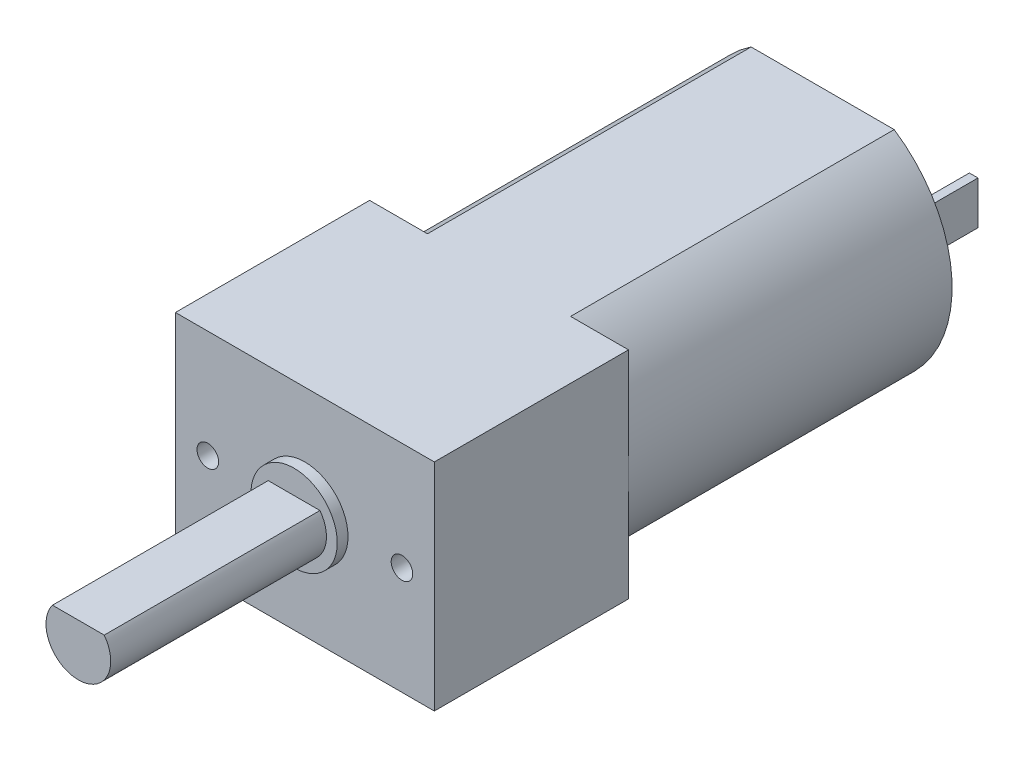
ISO-10303-21;
HEADER;
FILE_DESCRIPTION(('STEP AP214'),'2;1');
FILE_NAME('part.step','',(''),(''),'','','');
FILE_SCHEMA(('AUTOMOTIVE_DESIGN { 1 0 10303 214 1 1 1 1 }'));
ENDSEC;
DATA;
#1=APPLICATION_CONTEXT('core data for automotive mechanical design processes');
#2=APPLICATION_PROTOCOL_DEFINITION('international standard','automotive_design',2000,#1);
#3=PRODUCT_CONTEXT('',#1,'mechanical');
#4=PRODUCT('Part','Part','',(#3));
#5=PRODUCT_RELATED_PRODUCT_CATEGORY('part','',(#4));
#6=PRODUCT_DEFINITION_FORMATION('','',#4);
#7=PRODUCT_DEFINITION_CONTEXT('part definition',#1,'design');
#8=PRODUCT_DEFINITION('design','',#6,#7);
#9=PRODUCT_DEFINITION_SHAPE('','',#8);
#10=(LENGTH_UNIT() NAMED_UNIT(*) SI_UNIT(.MILLI.,.METRE.));
#11=(NAMED_UNIT(*) PLANE_ANGLE_UNIT() SI_UNIT($,.RADIAN.));
#12=(NAMED_UNIT(*) SI_UNIT($,.STERADIAN.) SOLID_ANGLE_UNIT());
#13=UNCERTAINTY_MEASURE_WITH_UNIT(LENGTH_MEASURE(1.E-05),#10,'distance_accuracy_value','');
#14=(GEOMETRIC_REPRESENTATION_CONTEXT(3) GLOBAL_UNCERTAINTY_ASSIGNED_CONTEXT((#13)) GLOBAL_UNIT_ASSIGNED_CONTEXT((#10,
#11,#12)) REPRESENTATION_CONTEXT('',''));
#15=CARTESIAN_POINT('',(0.,0.,0.));
#16=DIRECTION('',(0.,0.,1.));
#17=DIRECTION('',(1.,0.,0.));
#18=AXIS2_PLACEMENT_3D('',#15,#16,#17);
#19=CARTESIAN_POINT('',(0.,0.,19.5));
#20=DIRECTION('',(0.,0.,-1.));
#21=DIRECTION('',(-1.,0.,0.));
#22=AXIS2_PLACEMENT_3D('',#19,#20,#21);
#23=CYLINDRICAL_SURFACE('',#22,1.5);
#24=CARTESIAN_POINT('',(0.,0.,9.5));
#25=DIRECTION('',(0.,0.,1.));
#26=DIRECTION('',(1.,0.,0.));
#27=AXIS2_PLACEMENT_3D('',#24,#25,#26);
#28=CIRCLE('',#27,1.5);
#29=CARTESIAN_POINT('',(-1.2,0.899999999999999,9.5));
#30=VERTEX_POINT('',#29);
#31=CARTESIAN_POINT('',(1.2,0.899999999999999,9.5));
#32=VERTEX_POINT('',#31);
#33=EDGE_CURVE('E81',#30,#32,#28,.T.);
#34=ORIENTED_EDGE('',*,*,#33,.T.);
#35=DIRECTION('',(0.,0.,-1.));
#36=VECTOR('',#35,1.);
#37=CARTESIAN_POINT('',(1.2,0.899999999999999,19.5));
#38=LINE('',#37,#36);
#39=CARTESIAN_POINT('',(1.2,0.899999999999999,19.5));
#40=VERTEX_POINT('',#39);
#41=EDGE_CURVE('E12',#40,#32,#38,.T.);
#42=ORIENTED_EDGE('',*,*,#41,.F.);
#43=CARTESIAN_POINT('',(0.,0.,19.5));
#44=DIRECTION('',(0.,0.,1.));
#45=DIRECTION('',(1.,0.,0.));
#46=AXIS2_PLACEMENT_3D('',#43,#44,#45);
#47=CIRCLE('',#46,1.5);
#48=CARTESIAN_POINT('',(-1.2,0.899999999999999,19.5));
#49=VERTEX_POINT('',#48);
#50=EDGE_CURVE('E80',#49,#40,#47,.T.);
#51=ORIENTED_EDGE('',*,*,#50,.F.);
#52=DIRECTION('',(0.,0.,-1.));
#53=VECTOR('',#52,1.);
#54=CARTESIAN_POINT('',(-1.2,0.899999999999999,19.5));
#55=LINE('',#54,#53);
#56=EDGE_CURVE('E58',#49,#30,#55,.T.);
#57=ORIENTED_EDGE('',*,*,#56,.T.);
#58=EDGE_LOOP('',(#34,#42,#51,#57));
#59=FACE_BOUND('',#58,.T.);
#60=ADVANCED_FACE('F50',(#59),#23,.T.);
#61=CARTESIAN_POINT('',(-1.2,0.899999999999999,19.5));
#62=DIRECTION('',(0.,-1.,0.));
#63=DIRECTION('',(0.,0.,-1.));
#64=AXIS2_PLACEMENT_3D('',#61,#62,#63);
#65=PLANE('',#64);
#66=DIRECTION('',(-1.,0.,0.));
#67=VECTOR('',#66,1.);
#68=CARTESIAN_POINT('',(-1.2,0.899999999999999,9.5));
#69=LINE('',#68,#67);
#70=EDGE_CURVE('E73',#32,#30,#69,.T.);
#71=ORIENTED_EDGE('',*,*,#70,.T.);
#72=ORIENTED_EDGE('',*,*,#56,.F.);
#73=DIRECTION('',(-1.,0.,0.));
#74=VECTOR('',#73,1.);
#75=CARTESIAN_POINT('',(-1.2,0.899999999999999,19.5));
#76=LINE('',#75,#74);
#77=EDGE_CURVE('E65',#40,#49,#76,.T.);
#78=ORIENTED_EDGE('',*,*,#77,.F.);
#79=ORIENTED_EDGE('',*,*,#41,.T.);
#80=EDGE_LOOP('',(#71,#72,#78,#79));
#81=FACE_BOUND('',#80,.T.);
#82=ADVANCED_FACE('F76',(#81),#65,.F.);
#83=CARTESIAN_POINT('',(0.,0.,19.5));
#84=DIRECTION('',(0.,0.,1.));
#85=DIRECTION('',(1.,0.,0.));
#86=AXIS2_PLACEMENT_3D('',#83,#84,#85);
#87=PLANE('',#86);
#88=ORIENTED_EDGE('',*,*,#50,.T.);
#89=ORIENTED_EDGE('',*,*,#77,.T.);
#90=EDGE_LOOP('',(#88,#89));
#91=FACE_BOUND('',#90,.T.);
#92=ADVANCED_FACE('F88',(#91),#87,.T.);
#93=CARTESIAN_POINT('',(0.,0.,9.5));
#94=DIRECTION('',(0.,0.,1.));
#95=DIRECTION('',(1.,0.,0.));
#96=AXIS2_PLACEMENT_3D('',#93,#94,#95);
#97=PLANE('',#96);
#98=ORIENTED_EDGE('',*,*,#33,.F.);
#99=ORIENTED_EDGE('',*,*,#70,.F.);
#100=EDGE_LOOP('',(#98,#99));
#101=FACE_BOUND('',#100,.T.);
#102=ADVANCED_FACE('F84',(#101),#97,.F.);
#103=CLOSED_SHELL('',(#60,#82,#92,#102));
#104=MANIFOLD_SOLID_BREP('B2',#103);
#105=CARTESIAN_POINT('',(0.,0.,-15.));
#106=DIRECTION('',(0.,0.,-1.));
#107=DIRECTION('',(-1.,0.,0.));
#108=AXIS2_PLACEMENT_3D('',#105,#106,#107);
#109=PLANE('',#108);
#110=CARTESIAN_POINT('',(0.,0.,-15.));
#111=DIRECTION('',(0.,0.,-1.));
#112=DIRECTION('',(-1.,0.,0.));
#113=AXIS2_PLACEMENT_3D('',#110,#111,#112);
#114=CIRCLE('',#113,6.);
#115=CARTESIAN_POINT('',(3.3166247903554,5.,-15.));
#116=VERTEX_POINT('',#115);
#117=CARTESIAN_POINT('',(3.3166247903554,-5.,-15.));
#118=VERTEX_POINT('',#117);
#119=EDGE_CURVE('E310',#116,#118,#114,.T.);
#120=ORIENTED_EDGE('',*,*,#119,.T.);
#121=DIRECTION('',(-1.,0.,0.));
#122=VECTOR('',#121,1.);
#123=CARTESIAN_POINT('',(3.3166247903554,-5.,-15.));
#124=LINE('',#123,#122);
#125=CARTESIAN_POINT('',(-3.31662479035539,-5.,-15.));
#126=VERTEX_POINT('',#125);
#127=EDGE_CURVE('E313',#118,#126,#124,.T.);
#128=ORIENTED_EDGE('',*,*,#127,.T.);
#129=CARTESIAN_POINT('',(0.,0.,-15.));
#130=DIRECTION('',(0.,0.,-1.));
#131=DIRECTION('',(-1.,0.,0.));
#132=AXIS2_PLACEMENT_3D('',#129,#130,#131);
#133=CIRCLE('',#132,6.);
#134=CARTESIAN_POINT('',(-3.3166247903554,5.,-15.));
#135=VERTEX_POINT('',#134);
#136=EDGE_CURVE('E316',#126,#135,#133,.T.);
#137=ORIENTED_EDGE('',*,*,#136,.T.);
#138=DIRECTION('',(1.,0.,0.));
#139=VECTOR('',#138,1.);
#140=CARTESIAN_POINT('',(3.3166247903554,5.,-15.));
#141=LINE('',#140,#139);
#142=EDGE_CURVE('E318',#135,#116,#141,.T.);
#143=ORIENTED_EDGE('',*,*,#142,.T.);
#144=EDGE_LOOP('',(#120,#128,#137,#143));
#145=FACE_BOUND('',#144,.T.);
#146=DIRECTION('',(-1.,0.,0.));
#147=VECTOR('',#146,1.);
#148=CARTESIAN_POINT('',(3.2,-1.,-15.));
#149=LINE('',#148,#147);
#150=CARTESIAN_POINT('',(3.2,-1.,-15.));
#151=VERTEX_POINT('',#150);
#152=CARTESIAN_POINT('',(2.8,-1.,-15.));
#153=VERTEX_POINT('',#152);
#154=EDGE_CURVE('E276',#151,#153,#149,.T.);
#155=ORIENTED_EDGE('',*,*,#154,.F.);
#156=DIRECTION('',(0.,-1.,0.));
#157=VECTOR('',#156,1.);
#158=CARTESIAN_POINT('',(3.2,1.,-15.));
#159=LINE('',#158,#157);
#160=CARTESIAN_POINT('',(3.2,1.,-15.));
#161=VERTEX_POINT('',#160);
#162=EDGE_CURVE('E273',#161,#151,#159,.T.);
#163=ORIENTED_EDGE('',*,*,#162,.F.);
#164=DIRECTION('',(1.,0.,0.));
#165=VECTOR('',#164,1.);
#166=CARTESIAN_POINT('',(3.2,1.,-15.));
#167=LINE('',#166,#165);
#168=CARTESIAN_POINT('',(2.8,1.,-15.));
#169=VERTEX_POINT('',#168);
#170=EDGE_CURVE('E291',#169,#161,#167,.T.);
#171=ORIENTED_EDGE('',*,*,#170,.F.);
#172=DIRECTION('',(0.,1.,0.));
#173=VECTOR('',#172,1.);
#174=CARTESIAN_POINT('',(2.8,1.,-15.));
#175=LINE('',#174,#173);
#176=EDGE_CURVE('E299',#153,#169,#175,.T.);
#177=ORIENTED_EDGE('',*,*,#176,.F.);
#178=EDGE_LOOP('',(#155,#163,#171,#177));
#179=FACE_BOUND('',#178,.T.);
#180=DIRECTION('',(1.,0.,0.));
#181=VECTOR('',#180,1.);
#182=CARTESIAN_POINT('',(-3.2,1.,-15.));
#183=LINE('',#182,#181);
#184=CARTESIAN_POINT('',(-3.2,1.,-15.));
#185=VERTEX_POINT('',#184);
#186=CARTESIAN_POINT('',(-2.8,1.,-15.));
#187=VERTEX_POINT('',#186);
#188=EDGE_CURVE('E272',#185,#187,#183,.T.);
#189=ORIENTED_EDGE('',*,*,#188,.F.);
#190=DIRECTION('',(0.,1.,0.));
#191=VECTOR('',#190,1.);
#192=CARTESIAN_POINT('',(-3.2,1.,-15.));
#193=LINE('',#192,#191);
#194=CARTESIAN_POINT('',(-3.2,-1.,-15.));
#195=VERTEX_POINT('',#194);
#196=EDGE_CURVE('E267',#195,#185,#193,.T.);
#197=ORIENTED_EDGE('',*,*,#196,.F.);
#198=DIRECTION('',(-1.,0.,0.));
#199=VECTOR('',#198,1.);
#200=CARTESIAN_POINT('',(-3.2,-1.,-15.));
#201=LINE('',#200,#199);
#202=CARTESIAN_POINT('',(-2.8,-1.,-15.));
#203=VERTEX_POINT('',#202);
#204=EDGE_CURVE('E252',#203,#195,#201,.T.);
#205=ORIENTED_EDGE('',*,*,#204,.F.);
#206=DIRECTION('',(0.,-1.,0.));
#207=VECTOR('',#206,1.);
#208=CARTESIAN_POINT('',(-2.8,1.,-15.));
#209=LINE('',#208,#207);
#210=EDGE_CURVE('E260',#187,#203,#209,.T.);
#211=ORIENTED_EDGE('',*,*,#210,.F.);
#212=EDGE_LOOP('',(#189,#197,#205,#211));
#213=FACE_BOUND('',#212,.T.);
#214=ADVANCED_FACE('F129',(#145,#179,#213),#109,.T.);
#215=CARTESIAN_POINT('',(0.,0.,0.));
#216=DIRECTION('',(0.,0.,-1.));
#217=DIRECTION('',(-1.,0.,0.));
#218=AXIS2_PLACEMENT_3D('',#215,#216,#217);
#219=PLANE('',#218);
#220=CARTESIAN_POINT('',(0.,0.,0.));
#221=DIRECTION('',(0.,0.,-1.));
#222=DIRECTION('',(-1.,0.,0.));
#223=AXIS2_PLACEMENT_3D('',#220,#221,#222);
#224=CIRCLE('',#223,6.);
#225=CARTESIAN_POINT('',(3.3166247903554,5.,0.));
#226=VERTEX_POINT('',#225);
#227=CARTESIAN_POINT('',(6.,0.,0.));
#228=VERTEX_POINT('',#227);
#229=EDGE_CURVE('E140',#226,#228,#224,.T.);
#230=ORIENTED_EDGE('',*,*,#229,.F.);
#231=DIRECTION('',(-1.,0.,0.));
#232=VECTOR('',#231,1.);
#233=CARTESIAN_POINT('',(6.,5.,0.));
#234=LINE('',#233,#232);
#235=CARTESIAN_POINT('',(6.,5.,0.));
#236=VERTEX_POINT('',#235);
#237=EDGE_CURVE('E358',#236,#226,#234,.T.);
#238=ORIENTED_EDGE('',*,*,#237,.F.);
#239=DIRECTION('',(0.,1.,0.));
#240=VECTOR('',#239,1.);
#241=CARTESIAN_POINT('',(6.,5.,0.));
#242=LINE('',#241,#240);
#243=EDGE_CURVE('E372',#228,#236,#242,.T.);
#244=ORIENTED_EDGE('',*,*,#243,.F.);
#245=EDGE_LOOP('',(#230,#238,#244));
#246=FACE_BOUND('',#245,.T.);
#247=ADVANCED_FACE('F419',(#246),#219,.T.);
#248=CARTESIAN_POINT('',(3.3166247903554,-5.,0.));
#249=VERTEX_POINT('',#248);
#250=EDGE_CURVE('E48',#228,#249,#224,.T.);
#251=ORIENTED_EDGE('',*,*,#250,.F.);
#252=CARTESIAN_POINT('',(6.,-5.,0.));
#253=VERTEX_POINT('',#252);
#254=EDGE_CURVE('E373',#253,#228,#242,.T.);
#255=ORIENTED_EDGE('',*,*,#254,.F.);
#256=DIRECTION('',(1.,0.,0.));
#257=VECTOR('',#256,1.);
#258=CARTESIAN_POINT('',(6.,-5.,0.));
#259=LINE('',#258,#257);
#260=EDGE_CURVE('E368',#249,#253,#259,.T.);
#261=ORIENTED_EDGE('',*,*,#260,.F.);
#262=EDGE_LOOP('',(#251,#255,#261));
#263=FACE_BOUND('',#262,.T.);
#264=ADVANCED_FACE('F416',(#263),#219,.T.);
#265=CARTESIAN_POINT('',(0.,0.,0.));
#266=DIRECTION('',(0.,0.,-1.));
#267=DIRECTION('',(-1.,0.,0.));
#268=AXIS2_PLACEMENT_3D('',#265,#266,#267);
#269=CIRCLE('',#268,6.);
#270=CARTESIAN_POINT('',(-3.3166247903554,-5.,0.));
#271=VERTEX_POINT('',#270);
#272=CARTESIAN_POINT('',(-6.,0.,0.));
#273=VERTEX_POINT('',#272);
#274=EDGE_CURVE('E314',#271,#273,#269,.T.);
#275=ORIENTED_EDGE('',*,*,#274,.F.);
#276=CARTESIAN_POINT('',(-6.,-5.,0.));
#277=VERTEX_POINT('',#276);
#278=EDGE_CURVE('E369',#277,#271,#259,.T.);
#279=ORIENTED_EDGE('',*,*,#278,.F.);
#280=DIRECTION('',(0.,-1.,0.));
#281=VECTOR('',#280,1.);
#282=CARTESIAN_POINT('',(-6.,5.,0.));
#283=LINE('',#282,#281);
#284=EDGE_CURVE('E351',#273,#277,#283,.T.);
#285=ORIENTED_EDGE('',*,*,#284,.F.);
#286=EDGE_LOOP('',(#275,#279,#285));
#287=FACE_BOUND('',#286,.T.);
#288=ADVANCED_FACE('F400',(#287),#219,.T.);
#289=CARTESIAN_POINT('',(0.,0.,9.));
#290=DIRECTION('',(0.,0.,-1.));
#291=DIRECTION('',(-1.,0.,0.));
#292=AXIS2_PLACEMENT_3D('',#289,#290,#291);
#293=PLANE('',#292);
#294=CARTESIAN_POINT('',(0.,0.,9.));
#295=DIRECTION('',(0.,0.,1.));
#296=DIRECTION('',(1.,0.,0.));
#297=AXIS2_PLACEMENT_3D('',#294,#295,#296);
#298=CIRCLE('',#297,2.);
#299=CARTESIAN_POINT('',(2.,0.,9.));
#300=VERTEX_POINT('',#299);
#301=EDGE_CURVE('E339',#300,#300,#298,.T.);
#302=ORIENTED_EDGE('',*,*,#301,.F.);
#303=EDGE_LOOP('',(#302));
#304=FACE_BOUND('',#303,.T.);
#305=DIRECTION('',(0.,-1.,0.));
#306=VECTOR('',#305,1.);
#307=CARTESIAN_POINT('',(-6.,5.,9.));
#308=LINE('',#307,#306);
#309=CARTESIAN_POINT('',(-6.,5.,9.));
#310=VERTEX_POINT('',#309);
#311=CARTESIAN_POINT('',(-6.,-5.,9.));
#312=VERTEX_POINT('',#311);
#313=EDGE_CURVE('E354',#310,#312,#308,.T.);
#314=ORIENTED_EDGE('',*,*,#313,.T.);
#315=DIRECTION('',(1.,0.,0.));
#316=VECTOR('',#315,1.);
#317=CARTESIAN_POINT('',(6.,-5.,9.));
#318=LINE('',#317,#316);
#319=CARTESIAN_POINT('',(6.,-5.,9.));
#320=VERTEX_POINT('',#319);
#321=EDGE_CURVE('E357',#312,#320,#318,.T.);
#322=ORIENTED_EDGE('',*,*,#321,.T.);
#323=DIRECTION('',(0.,1.,0.));
#324=VECTOR('',#323,1.);
#325=CARTESIAN_POINT('',(6.,5.,9.));
#326=LINE('',#325,#324);
#327=CARTESIAN_POINT('',(6.,5.,9.));
#328=VERTEX_POINT('',#327);
#329=EDGE_CURVE('E360',#320,#328,#326,.T.);
#330=ORIENTED_EDGE('',*,*,#329,.T.);
#331=DIRECTION('',(-1.,0.,0.));
#332=VECTOR('',#331,1.);
#333=CARTESIAN_POINT('',(6.,5.,9.));
#334=LINE('',#333,#332);
#335=EDGE_CURVE('E362',#328,#310,#334,.T.);
#336=ORIENTED_EDGE('',*,*,#335,.T.);
#337=EDGE_LOOP('',(#314,#322,#330,#336));
#338=FACE_BOUND('',#337,.T.);
#339=CARTESIAN_POINT('',(-4.5,0.,9.));
#340=DIRECTION('',(0.,0.,1.));
#341=DIRECTION('',(1.,0.,0.));
#342=AXIS2_PLACEMENT_3D('',#339,#340,#341);
#343=CIRCLE('',#342,0.5);
#344=CARTESIAN_POINT('',(-4.,0.,9.));
#345=VERTEX_POINT('',#344);
#346=EDGE_CURVE('E348',#345,#345,#343,.T.);
#347=ORIENTED_EDGE('',*,*,#346,.F.);
#348=EDGE_LOOP('',(#347));
#349=FACE_BOUND('',#348,.T.);
#350=CARTESIAN_POINT('',(4.5,0.,9.));
#351=DIRECTION('',(0.,0.,1.));
#352=DIRECTION('',(1.,0.,0.));
#353=AXIS2_PLACEMENT_3D('',#350,#351,#352);
#354=CIRCLE('',#353,0.5);
#355=CARTESIAN_POINT('',(5.,0.,9.));
#356=VERTEX_POINT('',#355);
#357=EDGE_CURVE('E342',#356,#356,#354,.T.);
#358=ORIENTED_EDGE('',*,*,#357,.F.);
#359=EDGE_LOOP('',(#358));
#360=FACE_BOUND('',#359,.T.);
#361=ADVANCED_FACE('F467',(#304,#338,#349,#360),#293,.F.);
#362=CARTESIAN_POINT('',(-3.3166247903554,5.,0.));
#363=VERTEX_POINT('',#362);
#364=EDGE_CURVE('E138',#273,#363,#269,.T.);
#365=ORIENTED_EDGE('',*,*,#364,.F.);
#366=CARTESIAN_POINT('',(-6.,5.,0.));
#367=VERTEX_POINT('',#366);
#368=EDGE_CURVE('E365',#367,#273,#283,.T.);
#369=ORIENTED_EDGE('',*,*,#368,.F.);
#370=EDGE_CURVE('E376',#363,#367,#234,.T.);
#371=ORIENTED_EDGE('',*,*,#370,.F.);
#372=EDGE_LOOP('',(#365,#369,#371));
#373=FACE_BOUND('',#372,.T.);
#374=ADVANCED_FACE('F438',(#373),#219,.T.);
#375=CARTESIAN_POINT('',(-6.,5.,9.));
#376=DIRECTION('',(1.,0.,0.));
#377=DIRECTION('',(0.,1.,0.));
#378=AXIS2_PLACEMENT_3D('',#375,#376,#377);
#379=PLANE('',#378);
#380=ORIENTED_EDGE('',*,*,#368,.T.);
#381=ORIENTED_EDGE('',*,*,#284,.T.);
#382=DIRECTION('',(0.,0.,-1.));
#383=VECTOR('',#382,1.);
#384=CARTESIAN_POINT('',(-6.,-5.,9.));
#385=LINE('',#384,#383);
#386=EDGE_CURVE('E133',#312,#277,#385,.T.);
#387=ORIENTED_EDGE('',*,*,#386,.F.);
#388=ORIENTED_EDGE('',*,*,#313,.F.);
#389=DIRECTION('',(0.,0.,-1.));
#390=VECTOR('',#389,1.);
#391=CARTESIAN_POINT('',(-6.,5.,9.));
#392=LINE('',#391,#390);
#393=EDGE_CURVE('E364',#310,#367,#392,.T.);
#394=ORIENTED_EDGE('',*,*,#393,.T.);
#395=EDGE_LOOP('',(#380,#381,#387,#388,#394));
#396=FACE_BOUND('',#395,.T.);
#397=ADVANCED_FACE('F131',(#396),#379,.F.);
#398=CARTESIAN_POINT('',(6.,-5.,9.));
#399=DIRECTION('',(0.,1.,0.));
#400=DIRECTION('',(-1.,0.,0.));
#401=AXIS2_PLACEMENT_3D('',#398,#399,#400);
#402=PLANE('',#401);
#403=ORIENTED_EDGE('',*,*,#278,.T.);
#404=DIRECTION('',(0.,0.,1.));
#405=VECTOR('',#404,1.);
#406=CARTESIAN_POINT('',(-3.31662479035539,-5.,-15.));
#407=LINE('',#406,#405);
#408=EDGE_CURVE('E329',#126,#271,#407,.T.);
#409=ORIENTED_EDGE('',*,*,#408,.F.);
#410=ORIENTED_EDGE('',*,*,#127,.F.);
#411=DIRECTION('',(0.,0.,1.));
#412=VECTOR('',#411,1.);
#413=CARTESIAN_POINT('',(3.3166247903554,-5.,-15.));
#414=LINE('',#413,#412);
#415=EDGE_CURVE('E332',#118,#249,#414,.T.);
#416=ORIENTED_EDGE('',*,*,#415,.T.);
#417=ORIENTED_EDGE('',*,*,#260,.T.);
#418=DIRECTION('',(0.,0.,-1.));
#419=VECTOR('',#418,1.);
#420=CARTESIAN_POINT('',(6.,-5.,9.));
#421=LINE('',#420,#419);
#422=EDGE_CURVE('E383',#320,#253,#421,.T.);
#423=ORIENTED_EDGE('',*,*,#422,.F.);
#424=ORIENTED_EDGE('',*,*,#321,.F.);
#425=ORIENTED_EDGE('',*,*,#386,.T.);
#426=EDGE_LOOP('',(#403,#409,#410,#416,#417,#423,#424,#425));
#427=FACE_BOUND('',#426,.T.);
#428=ADVANCED_FACE('F392',(#427),#402,.F.);
#429=CARTESIAN_POINT('',(6.,5.,9.));
#430=DIRECTION('',(-1.,0.,0.));
#431=DIRECTION('',(0.,-1.,0.));
#432=AXIS2_PLACEMENT_3D('',#429,#430,#431);
#433=PLANE('',#432);
#434=ORIENTED_EDGE('',*,*,#254,.T.);
#435=ORIENTED_EDGE('',*,*,#243,.T.);
#436=DIRECTION('',(0.,0.,-1.));
#437=VECTOR('',#436,1.);
#438=CARTESIAN_POINT('',(6.,5.,9.));
#439=LINE('',#438,#437);
#440=EDGE_CURVE('E381',#328,#236,#439,.T.);
#441=ORIENTED_EDGE('',*,*,#440,.F.);
#442=ORIENTED_EDGE('',*,*,#329,.F.);
#443=ORIENTED_EDGE('',*,*,#422,.T.);
#444=EDGE_LOOP('',(#434,#435,#441,#442,#443));
#445=FACE_BOUND('',#444,.T.);
#446=ADVANCED_FACE('F421',(#445),#433,.F.);
#447=CARTESIAN_POINT('',(6.,5.,9.));
#448=DIRECTION('',(0.,-1.,0.));
#449=DIRECTION('',(1.,0.,0.));
#450=AXIS2_PLACEMENT_3D('',#447,#448,#449);
#451=PLANE('',#450);
#452=ORIENTED_EDGE('',*,*,#237,.T.);
#453=DIRECTION('',(0.,0.,1.));
#454=VECTOR('',#453,1.);
#455=CARTESIAN_POINT('',(3.3166247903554,5.,-15.));
#456=LINE('',#455,#454);
#457=EDGE_CURVE('E319',#116,#226,#456,.T.);
#458=ORIENTED_EDGE('',*,*,#457,.F.);
#459=ORIENTED_EDGE('',*,*,#142,.F.);
#460=DIRECTION('',(0.,0.,1.));
#461=VECTOR('',#460,1.);
#462=CARTESIAN_POINT('',(-3.3166247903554,5.,-15.));
#463=LINE('',#462,#461);
#464=EDGE_CURVE('E326',#135,#363,#463,.T.);
#465=ORIENTED_EDGE('',*,*,#464,.T.);
#466=ORIENTED_EDGE('',*,*,#370,.T.);
#467=ORIENTED_EDGE('',*,*,#393,.F.);
#468=ORIENTED_EDGE('',*,*,#335,.F.);
#469=ORIENTED_EDGE('',*,*,#440,.T.);
#470=EDGE_LOOP('',(#452,#458,#459,#465,#466,#467,#468,#469));
#471=FACE_BOUND('',#470,.T.);
#472=ADVANCED_FACE('F423',(#471),#451,.F.);
#473=CARTESIAN_POINT('',(-4.5,0.,9.));
#474=DIRECTION('',(0.,0.,-1.));
#475=DIRECTION('',(-1.,0.,0.));
#476=AXIS2_PLACEMENT_3D('',#473,#474,#475);
#477=CYLINDRICAL_SURFACE('',#476,0.5);
#478=ORIENTED_EDGE('',*,*,#346,.T.);
#479=EDGE_LOOP('',(#478));
#480=FACE_BOUND('',#479,.T.);
#481=CARTESIAN_POINT('',(-4.5,0.,0.));
#482=DIRECTION('',(0.,0.,1.));
#483=DIRECTION('',(1.,0.,0.));
#484=AXIS2_PLACEMENT_3D('',#481,#482,#483);
#485=CIRCLE('',#484,0.5);
#486=CARTESIAN_POINT('',(-4.,0.,0.));
#487=VERTEX_POINT('',#486);
#488=EDGE_CURVE('E345',#487,#487,#485,.T.);
#489=ORIENTED_EDGE('',*,*,#488,.F.);
#490=EDGE_LOOP('',(#489));
#491=FACE_BOUND('',#490,.T.);
#492=ADVANCED_FACE('F429',(#480,#491),#477,.F.);
#493=CARTESIAN_POINT('',(4.5,0.,9.));
#494=DIRECTION('',(0.,0.,-1.));
#495=DIRECTION('',(-1.,0.,0.));
#496=AXIS2_PLACEMENT_3D('',#493,#494,#495);
#497=CYLINDRICAL_SURFACE('',#496,0.5);
#498=ORIENTED_EDGE('',*,*,#357,.T.);
#499=EDGE_LOOP('',(#498));
#500=FACE_BOUND('',#499,.T.);
#501=CARTESIAN_POINT('',(4.5,0.,0.));
#502=DIRECTION('',(0.,0.,1.));
#503=DIRECTION('',(1.,0.,0.));
#504=AXIS2_PLACEMENT_3D('',#501,#502,#503);
#505=CIRCLE('',#504,0.5);
#506=CARTESIAN_POINT('',(5.,0.,0.));
#507=VERTEX_POINT('',#506);
#508=EDGE_CURVE('E338',#507,#507,#505,.T.);
#509=ORIENTED_EDGE('',*,*,#508,.F.);
#510=EDGE_LOOP('',(#509));
#511=FACE_BOUND('',#510,.T.);
#512=ADVANCED_FACE('F459',(#500,#511),#497,.F.);
#513=CARTESIAN_POINT('',(0.,0.,9.5));
#514=DIRECTION('',(0.,0.,-1.));
#515=DIRECTION('',(-1.,0.,0.));
#516=AXIS2_PLACEMENT_3D('',#513,#514,#515);
#517=CYLINDRICAL_SURFACE('',#516,2.);
#518=CARTESIAN_POINT('',(0.,0.,9.5));
#519=DIRECTION('',(0.,0.,1.));
#520=DIRECTION('',(1.,0.,0.));
#521=AXIS2_PLACEMENT_3D('',#518,#519,#520);
#522=CIRCLE('',#521,2.);
#523=CARTESIAN_POINT('',(2.,0.,9.5));
#524=VERTEX_POINT('',#523);
#525=EDGE_CURVE('E335',#524,#524,#522,.T.);
#526=ORIENTED_EDGE('',*,*,#525,.F.);
#527=EDGE_LOOP('',(#526));
#528=FACE_BOUND('',#527,.T.);
#529=ORIENTED_EDGE('',*,*,#301,.T.);
#530=EDGE_LOOP('',(#529));
#531=FACE_BOUND('',#530,.T.);
#532=ADVANCED_FACE('F455',(#528,#531),#517,.T.);
#533=CARTESIAN_POINT('',(0.,0.,9.5));
#534=DIRECTION('',(0.,0.,1.));
#535=DIRECTION('',(1.,0.,0.));
#536=AXIS2_PLACEMENT_3D('',#533,#534,#535);
#537=PLANE('',#536);
#538=ORIENTED_EDGE('',*,*,#525,.T.);
#539=EDGE_LOOP('',(#538));
#540=FACE_BOUND('',#539,.T.);
#541=ADVANCED_FACE('F450',(#540),#537,.T.);
#542=CARTESIAN_POINT('',(0.,0.,-15.));
#543=DIRECTION('',(0.,0.,1.));
#544=DIRECTION('',(1.,0.,0.));
#545=AXIS2_PLACEMENT_3D('',#542,#543,#544);
#546=CYLINDRICAL_SURFACE('',#545,6.);
#547=ORIENTED_EDGE('',*,*,#274,.T.);
#548=ORIENTED_EDGE('',*,*,#364,.T.);
#549=ORIENTED_EDGE('',*,*,#464,.F.);
#550=ORIENTED_EDGE('',*,*,#136,.F.);
#551=ORIENTED_EDGE('',*,*,#408,.T.);
#552=EDGE_LOOP('',(#547,#548,#549,#550,#551));
#553=FACE_BOUND('',#552,.T.);
#554=ADVANCED_FACE('F403',(#553),#546,.T.);
#555=CARTESIAN_POINT('',(0.,0.,-15.));
#556=DIRECTION('',(0.,0.,1.));
#557=DIRECTION('',(1.,0.,0.));
#558=AXIS2_PLACEMENT_3D('',#555,#556,#557);
#559=CYLINDRICAL_SURFACE('',#558,6.);
#560=ORIENTED_EDGE('',*,*,#229,.T.);
#561=ORIENTED_EDGE('',*,*,#250,.T.);
#562=ORIENTED_EDGE('',*,*,#415,.F.);
#563=ORIENTED_EDGE('',*,*,#119,.F.);
#564=ORIENTED_EDGE('',*,*,#457,.T.);
#565=EDGE_LOOP('',(#560,#561,#562,#563,#564));
#566=FACE_BOUND('',#565,.T.);
#567=ADVANCED_FACE('F413',(#566),#559,.T.);
#568=CARTESIAN_POINT('',(0.,0.,0.));
#569=DIRECTION('',(0.,0.,-1.));
#570=DIRECTION('',(-1.,0.,0.));
#571=AXIS2_PLACEMENT_3D('',#568,#569,#570);
#572=PLANE('',#571);
#573=ORIENTED_EDGE('',*,*,#508,.T.);
#574=EDGE_LOOP('',(#573));
#575=FACE_BOUND('',#574,.T.);
#576=ADVANCED_FACE('F446',(#575),#572,.F.);
#577=ORIENTED_EDGE('',*,*,#488,.T.);
#578=EDGE_LOOP('',(#577));
#579=FACE_BOUND('',#578,.T.);
#580=ADVANCED_FACE('F443',(#579),#572,.F.);
#581=CARTESIAN_POINT('',(3.2,1.,-19.));
#582=DIRECTION('',(-1.,0.,0.));
#583=DIRECTION('',(0.,-1.,0.));
#584=AXIS2_PLACEMENT_3D('',#581,#582,#583);
#585=PLANE('',#584);
#586=ORIENTED_EDGE('',*,*,#162,.T.);
#587=DIRECTION('',(0.,0.,1.));
#588=VECTOR('',#587,1.);
#589=CARTESIAN_POINT('',(3.2,-1.,-19.));
#590=LINE('',#589,#588);
#591=CARTESIAN_POINT('',(3.2,-1.,-19.));
#592=VERTEX_POINT('',#591);
#593=EDGE_CURVE('E308',#592,#151,#590,.T.);
#594=ORIENTED_EDGE('',*,*,#593,.F.);
#595=DIRECTION('',(0.,-1.,0.));
#596=VECTOR('',#595,1.);
#597=CARTESIAN_POINT('',(3.2,1.,-19.));
#598=LINE('',#597,#596);
#599=CARTESIAN_POINT('',(3.2,1.,-19.));
#600=VERTEX_POINT('',#599);
#601=EDGE_CURVE('E287',#600,#592,#598,.T.);
#602=ORIENTED_EDGE('',*,*,#601,.F.);
#603=DIRECTION('',(0.,0.,1.));
#604=VECTOR('',#603,1.);
#605=CARTESIAN_POINT('',(3.2,1.,-19.));
#606=LINE('',#605,#604);
#607=EDGE_CURVE('E296',#600,#161,#606,.T.);
#608=ORIENTED_EDGE('',*,*,#607,.T.);
#609=EDGE_LOOP('',(#586,#594,#602,#608));
#610=FACE_BOUND('',#609,.T.);
#611=ADVANCED_FACE('F441',(#610),#585,.F.);
#612=CARTESIAN_POINT('',(3.2,-1.,-19.));
#613=DIRECTION('',(0.,1.,0.));
#614=DIRECTION('',(0.,0.,1.));
#615=AXIS2_PLACEMENT_3D('',#612,#613,#614);
#616=PLANE('',#615);
#617=ORIENTED_EDGE('',*,*,#154,.T.);
#618=DIRECTION('',(0.,0.,1.));
#619=VECTOR('',#618,1.);
#620=CARTESIAN_POINT('',(2.8,-1.,-19.));
#621=LINE('',#620,#619);
#622=CARTESIAN_POINT('',(2.8,-1.,-19.));
#623=VERTEX_POINT('',#622);
#624=EDGE_CURVE('E305',#623,#153,#621,.T.);
#625=ORIENTED_EDGE('',*,*,#624,.F.);
#626=DIRECTION('',(-1.,0.,0.));
#627=VECTOR('',#626,1.);
#628=CARTESIAN_POINT('',(3.2,-1.,-19.));
#629=LINE('',#628,#627);
#630=EDGE_CURVE('E290',#592,#623,#629,.T.);
#631=ORIENTED_EDGE('',*,*,#630,.F.);
#632=ORIENTED_EDGE('',*,*,#593,.T.);
#633=EDGE_LOOP('',(#617,#625,#631,#632));
#634=FACE_BOUND('',#633,.T.);
#635=ADVANCED_FACE('F578',(#634),#616,.F.);
#636=CARTESIAN_POINT('',(2.8,1.,-19.));
#637=DIRECTION('',(1.,0.,0.));
#638=DIRECTION('',(0.,0.,-1.));
#639=AXIS2_PLACEMENT_3D('',#636,#637,#638);
#640=PLANE('',#639);
#641=ORIENTED_EDGE('',*,*,#176,.T.);
#642=DIRECTION('',(0.,0.,1.));
#643=VECTOR('',#642,1.);
#644=CARTESIAN_POINT('',(2.8,1.,-19.));
#645=LINE('',#644,#643);
#646=CARTESIAN_POINT('',(2.8,1.,-19.));
#647=VERTEX_POINT('',#646);
#648=EDGE_CURVE('E155',#647,#169,#645,.T.);
#649=ORIENTED_EDGE('',*,*,#648,.F.);
#650=DIRECTION('',(0.,1.,0.));
#651=VECTOR('',#650,1.);
#652=CARTESIAN_POINT('',(2.8,1.,-19.));
#653=LINE('',#652,#651);
#654=EDGE_CURVE('E293',#623,#647,#653,.T.);
#655=ORIENTED_EDGE('',*,*,#654,.F.);
#656=ORIENTED_EDGE('',*,*,#624,.T.);
#657=EDGE_LOOP('',(#641,#649,#655,#656));
#658=FACE_BOUND('',#657,.T.);
#659=ADVANCED_FACE('F588',(#658),#640,.F.);
#660=CARTESIAN_POINT('',(3.2,1.,-19.));
#661=DIRECTION('',(0.,-1.,0.));
#662=DIRECTION('',(0.,0.,-1.));
#663=AXIS2_PLACEMENT_3D('',#660,#661,#662);
#664=PLANE('',#663);
#665=ORIENTED_EDGE('',*,*,#170,.T.);
#666=ORIENTED_EDGE('',*,*,#607,.F.);
#667=DIRECTION('',(1.,0.,0.));
#668=VECTOR('',#667,1.);
#669=CARTESIAN_POINT('',(3.2,1.,-19.));
#670=LINE('',#669,#668);
#671=EDGE_CURVE('E295',#647,#600,#670,.T.);
#672=ORIENTED_EDGE('',*,*,#671,.F.);
#673=ORIENTED_EDGE('',*,*,#648,.T.);
#674=EDGE_LOOP('',(#665,#666,#672,#673));
#675=FACE_BOUND('',#674,.T.);
#676=ADVANCED_FACE('F598',(#675),#664,.F.);
#677=CARTESIAN_POINT('',(0.,0.,-19.));
#678=DIRECTION('',(0.,0.,-1.));
#679=DIRECTION('',(-1.,0.,0.));
#680=AXIS2_PLACEMENT_3D('',#677,#678,#679);
#681=PLANE('',#680);
#682=ORIENTED_EDGE('',*,*,#601,.T.);
#683=ORIENTED_EDGE('',*,*,#630,.T.);
#684=ORIENTED_EDGE('',*,*,#654,.T.);
#685=ORIENTED_EDGE('',*,*,#671,.T.);
#686=EDGE_LOOP('',(#682,#683,#684,#685));
#687=FACE_BOUND('',#686,.T.);
#688=ADVANCED_FACE('F609',(#687),#681,.T.);
#689=CARTESIAN_POINT('',(-3.2,1.,-19.));
#690=DIRECTION('',(1.,0.,0.));
#691=DIRECTION('',(0.,1.,0.));
#692=AXIS2_PLACEMENT_3D('',#689,#690,#691);
#693=PLANE('',#692);
#694=ORIENTED_EDGE('',*,*,#196,.T.);
#695=DIRECTION('',(0.,0.,1.));
#696=VECTOR('',#695,1.);
#697=CARTESIAN_POINT('',(-3.2,1.,-19.));
#698=LINE('',#697,#696);
#699=CARTESIAN_POINT('',(-3.2,1.,-19.));
#700=VERTEX_POINT('',#699);
#701=EDGE_CURVE('E691',#700,#185,#698,.T.);
#702=ORIENTED_EDGE('',*,*,#701,.F.);
#703=DIRECTION('',(0.,1.,0.));
#704=VECTOR('',#703,1.);
#705=CARTESIAN_POINT('',(-3.2,1.,-19.));
#706=LINE('',#705,#704);
#707=CARTESIAN_POINT('',(-3.2,-1.,-19.));
#708=VERTEX_POINT('',#707);
#709=EDGE_CURVE('E261',#708,#700,#706,.T.);
#710=ORIENTED_EDGE('',*,*,#709,.F.);
#711=DIRECTION('',(0.,0.,1.));
#712=VECTOR('',#711,1.);
#713=CARTESIAN_POINT('',(-3.2,-1.,-19.));
#714=LINE('',#713,#712);
#715=EDGE_CURVE('E255',#708,#195,#714,.T.);
#716=ORIENTED_EDGE('',*,*,#715,.T.);
#717=EDGE_LOOP('',(#694,#702,#710,#716));
#718=FACE_BOUND('',#717,.T.);
#719=ADVANCED_FACE('F265',(#718),#693,.F.);
#720=CARTESIAN_POINT('',(-3.2,1.,-19.));
#721=DIRECTION('',(0.,-1.,0.));
#722=DIRECTION('',(0.,0.,-1.));
#723=AXIS2_PLACEMENT_3D('',#720,#721,#722);
#724=PLANE('',#723);
#725=ORIENTED_EDGE('',*,*,#188,.T.);
#726=DIRECTION('',(0.,0.,1.));
#727=VECTOR('',#726,1.);
#728=CARTESIAN_POINT('',(-2.8,1.,-19.));
#729=LINE('',#728,#727);
#730=CARTESIAN_POINT('',(-2.8,1.,-19.));
#731=VERTEX_POINT('',#730);
#732=EDGE_CURVE('E692',#731,#187,#729,.T.);
#733=ORIENTED_EDGE('',*,*,#732,.F.);
#734=DIRECTION('',(1.,0.,0.));
#735=VECTOR('',#734,1.);
#736=CARTESIAN_POINT('',(-3.2,1.,-19.));
#737=LINE('',#736,#735);
#738=EDGE_CURVE('E284',#700,#731,#737,.T.);
#739=ORIENTED_EDGE('',*,*,#738,.F.);
#740=ORIENTED_EDGE('',*,*,#701,.T.);
#741=EDGE_LOOP('',(#725,#733,#739,#740));
#742=FACE_BOUND('',#741,.T.);
#743=ADVANCED_FACE('F629',(#742),#724,.F.);
#744=CARTESIAN_POINT('',(-2.8,1.,-19.));
#745=DIRECTION('',(-1.,0.,0.));
#746=DIRECTION('',(0.,0.,1.));
#747=AXIS2_PLACEMENT_3D('',#744,#745,#746);
#748=PLANE('',#747);
#749=ORIENTED_EDGE('',*,*,#210,.T.);
#750=DIRECTION('',(0.,0.,1.));
#751=VECTOR('',#750,1.);
#752=CARTESIAN_POINT('',(-2.8,-1.,-19.));
#753=LINE('',#752,#751);
#754=CARTESIAN_POINT('',(-2.8,-1.,-19.));
#755=VERTEX_POINT('',#754);
#756=EDGE_CURVE('E147',#755,#203,#753,.T.);
#757=ORIENTED_EDGE('',*,*,#756,.F.);
#758=DIRECTION('',(0.,-1.,0.));
#759=VECTOR('',#758,1.);
#760=CARTESIAN_POINT('',(-2.8,1.,-19.));
#761=LINE('',#760,#759);
#762=EDGE_CURVE('E282',#731,#755,#761,.T.);
#763=ORIENTED_EDGE('',*,*,#762,.F.);
#764=ORIENTED_EDGE('',*,*,#732,.T.);
#765=EDGE_LOOP('',(#749,#757,#763,#764));
#766=FACE_BOUND('',#765,.T.);
#767=ADVANCED_FACE('F639',(#766),#748,.F.);
#768=CARTESIAN_POINT('',(-3.2,-1.,-19.));
#769=DIRECTION('',(0.,1.,0.));
#770=DIRECTION('',(0.,0.,1.));
#771=AXIS2_PLACEMENT_3D('',#768,#769,#770);
#772=PLANE('',#771);
#773=ORIENTED_EDGE('',*,*,#204,.T.);
#774=ORIENTED_EDGE('',*,*,#715,.F.);
#775=DIRECTION('',(-1.,0.,0.));
#776=VECTOR('',#775,1.);
#777=CARTESIAN_POINT('',(-3.2,-1.,-19.));
#778=LINE('',#777,#776);
#779=EDGE_CURVE('E270',#755,#708,#778,.T.);
#780=ORIENTED_EDGE('',*,*,#779,.F.);
#781=ORIENTED_EDGE('',*,*,#756,.T.);
#782=EDGE_LOOP('',(#773,#774,#780,#781));
#783=FACE_BOUND('',#782,.T.);
#784=ADVANCED_FACE('F254',(#783),#772,.F.);
#785=CARTESIAN_POINT('',(0.,0.,-19.));
#786=DIRECTION('',(0.,0.,1.));
#787=DIRECTION('',(1.,0.,0.));
#788=AXIS2_PLACEMENT_3D('',#785,#786,#787);
#789=PLANE('',#788);
#790=ORIENTED_EDGE('',*,*,#709,.T.);
#791=ORIENTED_EDGE('',*,*,#738,.T.);
#792=ORIENTED_EDGE('',*,*,#762,.T.);
#793=ORIENTED_EDGE('',*,*,#779,.T.);
#794=EDGE_LOOP('',(#790,#791,#792,#793));
#795=FACE_BOUND('',#794,.T.);
#796=ADVANCED_FACE('F660',(#795),#789,.F.);
#797=CLOSED_SHELL('',(#214,#247,#264,#288,#361,#374,#397,#428,#446,#472,#492,#512,#532,#541,
#554,#567,#576,#580,#611,#635,#659,#676,#688,#719,#743,#767,#784,#796));
#798=MANIFOLD_SOLID_BREP('B6',#797);
#799=ADVANCED_BREP_SHAPE_REPRESENTATION('',(#18,#104,#798),#14);
#800=SHAPE_DEFINITION_REPRESENTATION(#9,#799);
ENDSEC;
END-ISO-10303-21;
